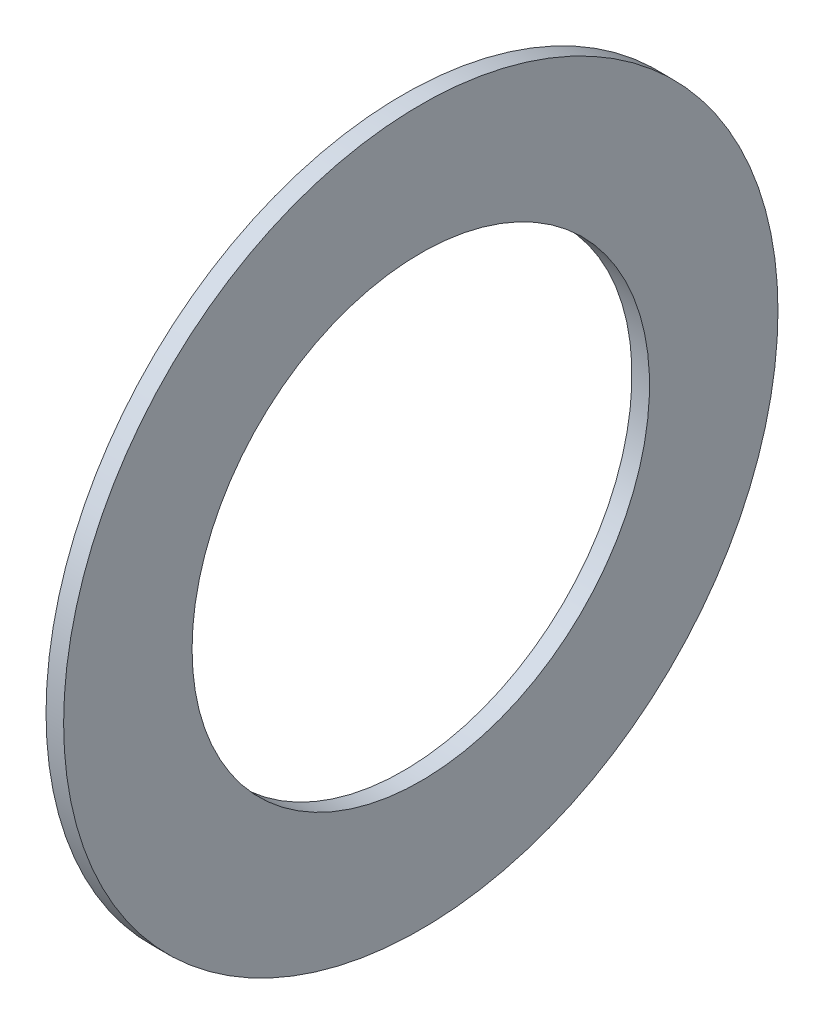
ISO-10303-21;
HEADER;
FILE_DESCRIPTION(('STEP AP214'),'2;1');
FILE_NAME('part.step','',(''),(''),'','','');
FILE_SCHEMA(('AUTOMOTIVE_DESIGN { 1 0 10303 214 1 1 1 1 }'));
ENDSEC;
DATA;
#1=APPLICATION_CONTEXT('core data for automotive mechanical design processes');
#2=APPLICATION_PROTOCOL_DEFINITION('international standard','automotive_design',2000,#1);
#3=PRODUCT_CONTEXT('',#1,'mechanical');
#4=PRODUCT('Part','Part','',(#3));
#5=PRODUCT_RELATED_PRODUCT_CATEGORY('part','',(#4));
#6=PRODUCT_DEFINITION_FORMATION('','',#4);
#7=PRODUCT_DEFINITION_CONTEXT('part definition',#1,'design');
#8=PRODUCT_DEFINITION('design','',#6,#7);
#9=PRODUCT_DEFINITION_SHAPE('','',#8);
#10=(LENGTH_UNIT() NAMED_UNIT(*) SI_UNIT(.MILLI.,.METRE.));
#11=(NAMED_UNIT(*) PLANE_ANGLE_UNIT() SI_UNIT($,.RADIAN.));
#12=(NAMED_UNIT(*) SI_UNIT($,.STERADIAN.) SOLID_ANGLE_UNIT());
#13=UNCERTAINTY_MEASURE_WITH_UNIT(LENGTH_MEASURE(1.E-05),#10,'distance_accuracy_value','');
#14=(GEOMETRIC_REPRESENTATION_CONTEXT(3) GLOBAL_UNCERTAINTY_ASSIGNED_CONTEXT((#13)) GLOBAL_UNIT_ASSIGNED_CONTEXT((#10,
#11,#12)) REPRESENTATION_CONTEXT('',''));
#15=CARTESIAN_POINT('',(0.,0.,0.));
#16=DIRECTION('',(0.,0.,1.));
#17=DIRECTION('',(1.,0.,0.));
#18=AXIS2_PLACEMENT_3D('',#15,#16,#17);
#19=CARTESIAN_POINT('',(0.,20.3,0.));
#20=DIRECTION('',(-1.,0.,0.));
#21=DIRECTION('',(0.,0.,1.));
#22=AXIS2_PLACEMENT_3D('',#19,#20,#21);
#23=PLANE('',#22);
#24=CARTESIAN_POINT('',(0.,0.,0.));
#25=DIRECTION('',(-1.,0.,0.));
#26=DIRECTION('',(0.,0.,1.));
#27=AXIS2_PLACEMENT_3D('',#24,#25,#26);
#28=CIRCLE('',#27,20.3);
#29=CARTESIAN_POINT('',(0.,0.,20.3));
#30=VERTEX_POINT('',#29);
#31=EDGE_CURVE('E40',#30,#30,#28,.T.);
#32=ORIENTED_EDGE('',*,*,#31,.F.);
#33=EDGE_LOOP('',(#32));
#34=FACE_BOUND('',#33,.T.);
#35=CARTESIAN_POINT('',(0.,0.,0.));
#36=DIRECTION('',(-1.,0.,0.));
#37=DIRECTION('',(0.,0.,1.));
#38=AXIS2_PLACEMENT_3D('',#35,#36,#37);
#39=CIRCLE('',#38,13.);
#40=CARTESIAN_POINT('',(0.,0.,13.));
#41=VERTEX_POINT('',#40);
#42=EDGE_CURVE('E10',#41,#41,#39,.T.);
#43=ORIENTED_EDGE('',*,*,#42,.T.);
#44=EDGE_LOOP('',(#43));
#45=FACE_BOUND('',#44,.T.);
#46=ADVANCED_FACE('F26',(#34,#45),#23,.F.);
#47=CARTESIAN_POINT('',(-16.9214084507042,0.,0.));
#48=DIRECTION('',(-1.,0.,0.));
#49=DIRECTION('',(0.,0.,1.));
#50=AXIS2_PLACEMENT_3D('',#47,#48,#49);
#51=CYLINDRICAL_SURFACE('',#50,13.);
#52=ORIENTED_EDGE('',*,*,#42,.F.);
#53=EDGE_LOOP('',(#52));
#54=FACE_BOUND('',#53,.T.);
#55=CARTESIAN_POINT('',(-1.,0.,0.));
#56=DIRECTION('',(-1.,0.,0.));
#57=DIRECTION('',(0.,0.,1.));
#58=AXIS2_PLACEMENT_3D('',#55,#56,#57);
#59=CIRCLE('',#58,13.);
#60=CARTESIAN_POINT('',(-1.,0.,13.));
#61=VERTEX_POINT('',#60);
#62=EDGE_CURVE('E32',#61,#61,#59,.T.);
#63=ORIENTED_EDGE('',*,*,#62,.T.);
#64=EDGE_LOOP('',(#63));
#65=FACE_BOUND('',#64,.T.);
#66=ADVANCED_FACE('F49',(#54,#65),#51,.F.);
#67=CARTESIAN_POINT('',(-1.,20.3,0.));
#68=DIRECTION('',(1.,0.,0.));
#69=DIRECTION('',(0.,0.,-1.));
#70=AXIS2_PLACEMENT_3D('',#67,#68,#69);
#71=PLANE('',#70);
#72=ORIENTED_EDGE('',*,*,#62,.F.);
#73=EDGE_LOOP('',(#72));
#74=FACE_BOUND('',#73,.T.);
#75=CARTESIAN_POINT('',(-1.,0.,0.));
#76=DIRECTION('',(-1.,0.,0.));
#77=DIRECTION('',(0.,0.,1.));
#78=AXIS2_PLACEMENT_3D('',#75,#76,#77);
#79=CIRCLE('',#78,20.3);
#80=CARTESIAN_POINT('',(-1.,0.,20.3));
#81=VERTEX_POINT('',#80);
#82=EDGE_CURVE('E36',#81,#81,#79,.T.);
#83=ORIENTED_EDGE('',*,*,#82,.T.);
#84=EDGE_LOOP('',(#83));
#85=FACE_BOUND('',#84,.T.);
#86=ADVANCED_FACE('F53',(#74,#85),#71,.F.);
#87=CARTESIAN_POINT('',(-16.9214084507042,0.,0.));
#88=DIRECTION('',(-1.,0.,0.));
#89=DIRECTION('',(0.,0.,1.));
#90=AXIS2_PLACEMENT_3D('',#87,#88,#89);
#91=CYLINDRICAL_SURFACE('',#90,20.3);
#92=ORIENTED_EDGE('',*,*,#82,.F.);
#93=EDGE_LOOP('',(#92));
#94=FACE_BOUND('',#93,.T.);
#95=ORIENTED_EDGE('',*,*,#31,.T.);
#96=EDGE_LOOP('',(#95));
#97=FACE_BOUND('',#96,.T.);
#98=ADVANCED_FACE('F46',(#94,#97),#91,.T.);
#99=CLOSED_SHELL('',(#46,#66,#86,#98));
#100=MANIFOLD_SOLID_BREP('B2',#99);
#101=ADVANCED_BREP_SHAPE_REPRESENTATION('',(#18,#100),#14);
#102=SHAPE_DEFINITION_REPRESENTATION(#9,#101);
ENDSEC;
END-ISO-10303-21;
